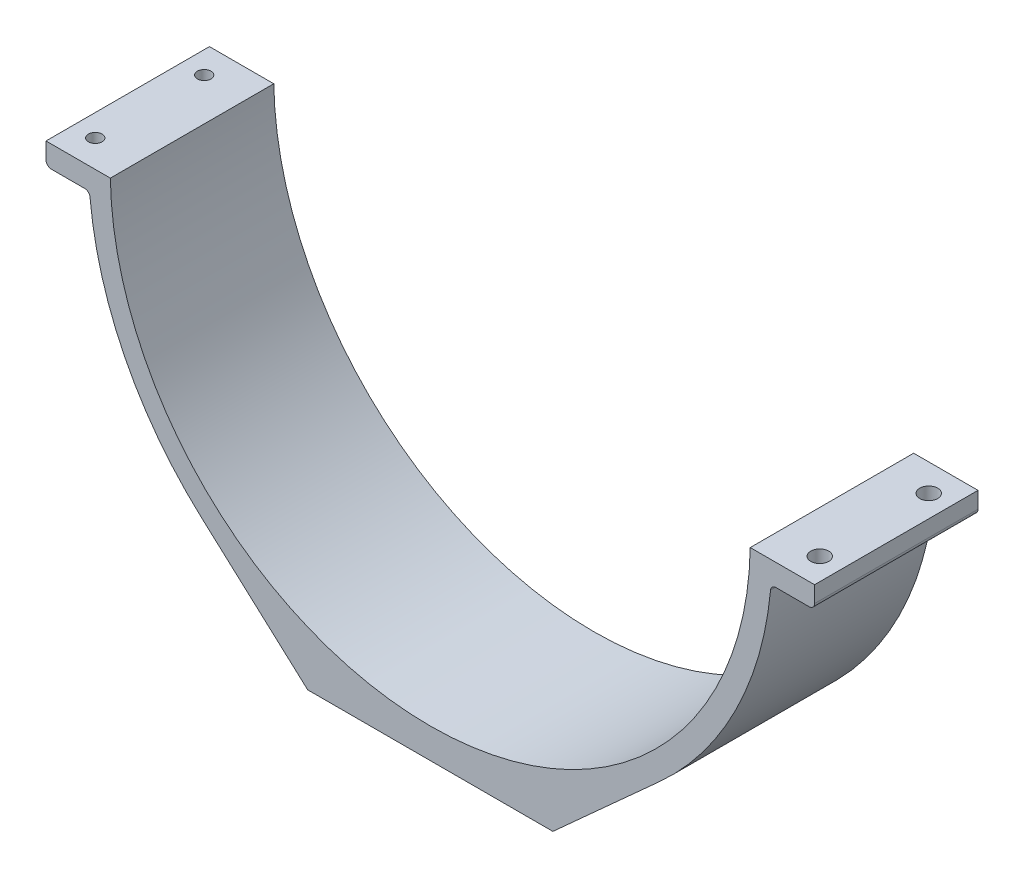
from build123d import *

# Parameters (mm, degrees)
BOSS_EXTRUDE1_DEPTH       = 30
M3X0_5_TAPPED_HOLE1_D     = 2.5
M4X0_7_TAPPED_HOLE1_D     = 3.3
M4X0_7_TAPPED_HOLE1_DEPTH = 7.5
M4X0_7_TAPPED_HOLE1_TIP   = 0.991420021
SKETCH9_R                 = 1.65
CUT_EXTRUDE1_DEPTH        = 97.877925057


with BuildPart() as part:
    # Sketch1 → Boss-Extrude1 (new body)
    with BuildSketch(Plane.XY):
        with BuildLine():
            Line((-70.540447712, -1), (-58.731487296, -1))
            ThreePointArc((-58.731487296, -1), (0, -58.74), (58.731487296, -1))
            Line((58.731487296, -1), (70.540447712, -1))
            Line((70.540447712, -1), (70.540447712, -4))
            ThreePointArc((70.540447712, -4), (70.247554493, -4.707106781), (69.540447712, -5))
            Line((69.540447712, -5), (63.4569744, -5))
            ThreePointArc((63.4569744, -5), (62.783970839, -5.260360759), (62.461414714, -5.905867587))
            ThreePointArc((62.461414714, -5.905867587), (56.0792262, -28.132329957), (42.078666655, -46.537011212))
            Line((42.078666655, -46.537011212), (22.5, -64.24))
            Line((22.5, -64.24), (-22.5, -64.24))
            Line((-22.5, -64.24), (-42.078666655, -46.537011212))
            ThreePointArc((-42.078666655, -46.537011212), (-56.0792262, -28.132329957), (-62.461414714, -5.905867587))
            ThreePointArc((-62.461414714, -5.905867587), (-62.783970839, -5.260360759), (-63.4569744, -5))
            Line((-63.4569744, -5), (-69.540447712, -5))
            ThreePointArc((-69.540447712, -5), (-70.247554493, -4.707106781), (-70.540447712, -4))
            Line((-70.540447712, -4), (-70.540447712, -1))
        make_face()
    extrude(amount=BOSS_EXTRUDE1_DEPTH)

    # M3x0.5 Tapped Hole1 (through all)
    with Locations(Plane(origin=(-66.498711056, -5, 5), x_dir=(-1, 0, 0), z_dir=(0, -1, 0))):
        with Locations((0, 0), (0, -20)):
            Hole(M3X0_5_TAPPED_HOLE1_D / 2)

    # M4x0.7 Tapped Hole1
    with Locations(Plane(origin=(-20, -64.24, 5), x_dir=(0, 0, -1), z_dir=(0, -1, 0))):
        with Locations((0, 0), (0, 40), (-20, 0), (-20, 40)):
            Hole(M4X0_7_TAPPED_HOLE1_D / 2, depth=M4X0_7_TAPPED_HOLE1_DEPTH)
            with Locations((0, 0, -(M4X0_7_TAPPED_HOLE1_DEPTH + M4X0_7_TAPPED_HOLE1_TIP / 2))):  # 118° drill point
                Cone(0, M4X0_7_TAPPED_HOLE1_D / 2, M4X0_7_TAPPED_HOLE1_TIP, mode=Mode.SUBTRACT)

    # Sketch9 → Cut-Extrude1 (cut, through all)
    with BuildSketch(Plane.XZ.offset(5)):
        with Locations(Location((66.498711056, 25, 0), (0, 0, 270))):
            Circle(SKETCH9_R)
        with Locations(Location((66.498711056, 5, 0), (0, 0, 270))):
            Circle(SKETCH9_R)
    extrude(amount=-CUT_EXTRUDE1_DEPTH, mode=Mode.SUBTRACT)


solid = part.part
